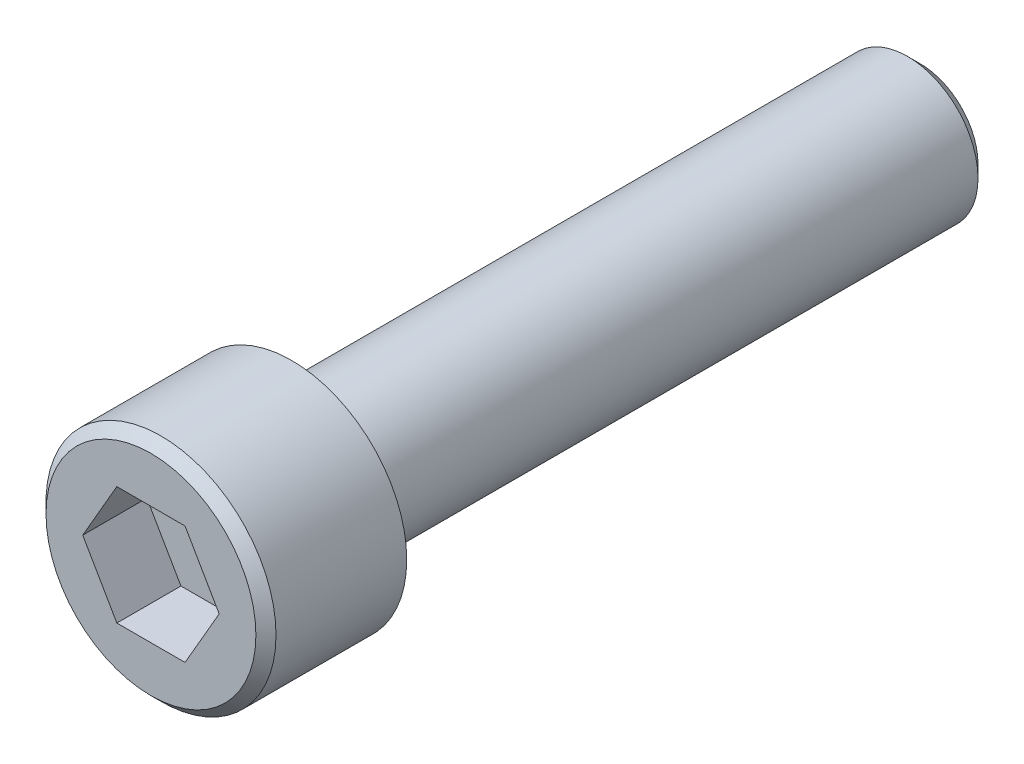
from build123d import *

# Parameters (mm, degrees)
SKETCH1_R           = 2.3241
HEAD_DEPTH          = 2.8448
SKETCH2_R           = 1.4224
SHANK_DEPTH         = 12.7
SOCKET_DEPTH        = 1.2954
BOTTOM_CHAMFER_SIZE = 0.254
TOP_CHAMFER_SIZE    = 0.2032
SKETCH4_R           = 0.3937
CUT_EXTRUDE1_DEPTH  = 16.8884766


with BuildPart() as part:
    # Sketch1 → Head (new body)
    with BuildSketch(Plane.XY):
        Circle(SKETCH1_R)
    extrude(amount=-HEAD_DEPTH)

    # Sketch2 → Shank (add)
    with BuildSketch(Plane(origin=(0, 0, -2.8448), x_dir=(-1, 0, 0), z_dir=(0, 0, -1))):
        with Locations(Location((0, 0, 0), (0, 0, 180))):
            Circle(SKETCH2_R)
    extrude(amount=SHANK_DEPTH)

    # Sketch3 → Socket (cut)
    with BuildSketch(Plane.XY):
        Polygon((1.378481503, 0), (0.689240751, 1.1938), (-0.689240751, 1.1938), (-1.378481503, 0), (-0.689240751, -1.1938), (0.689240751, -1.1938), align=None)
    extrude(amount=-SOCKET_DEPTH, mode=Mode.SUBTRACT)

    # Bottom Chamfer
    bottom_chamfer_edges = [part.edges().sort_by_distance(p)[0] for p in [
        (-1.4224, 0, -15.5448),
    ]]
    chamfer(bottom_chamfer_edges, length=BOTTOM_CHAMFER_SIZE)

    # Top Chamfer
    top_chamfer_edges = [part.edges().sort_by_distance(p)[0] for p in [
        (-2.3241, 0, 0),
    ]]
    chamfer(top_chamfer_edges, length=TOP_CHAMFER_SIZE)

    # Sketch4 → Cut-Extrude1 (cut, through all)
    with BuildSketch(Plane(origin=(0, 0, -15.5448), x_dir=(-1, 0, 0), z_dir=(0, 0, -1))):
        Circle(SKETCH4_R)
    extrude(amount=-CUT_EXTRUDE1_DEPTH, mode=Mode.SUBTRACT)


solid = part.part
